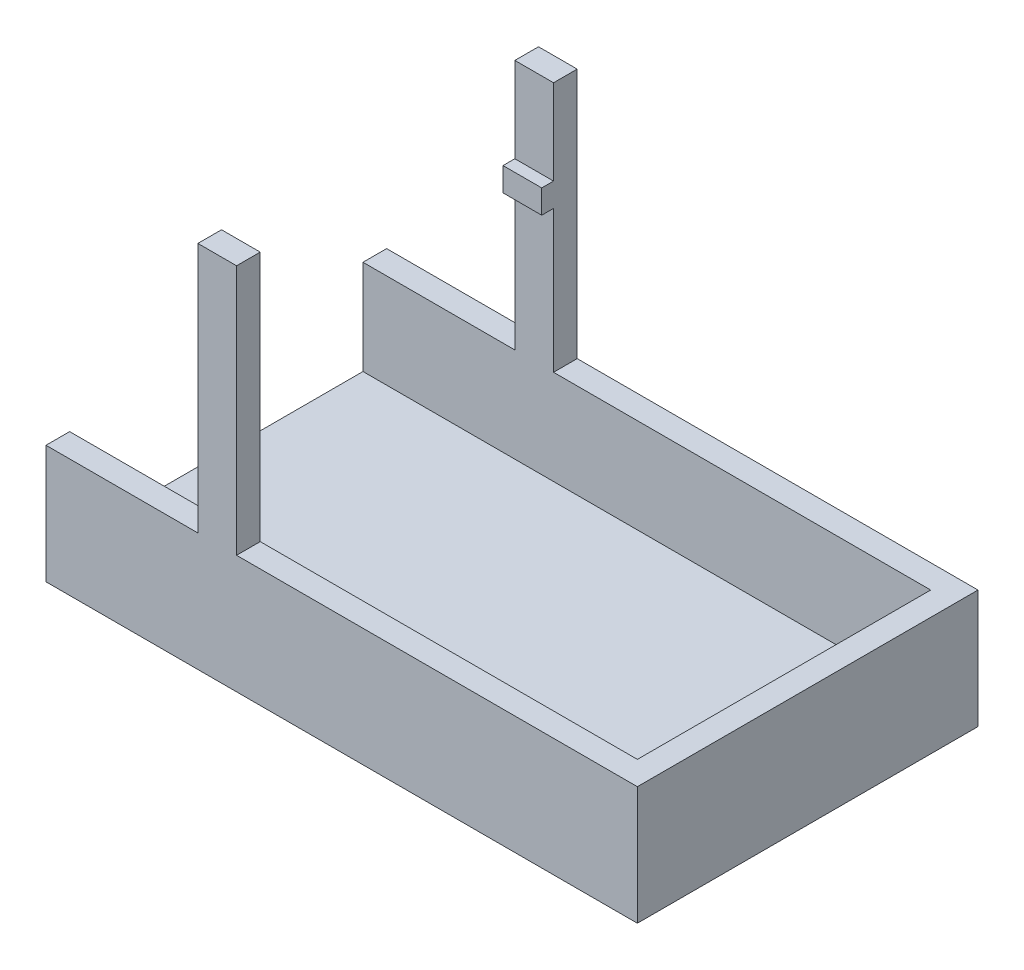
from build123d import *

# Parameters (mm, degrees)
SKETCH1_W      = 250
SKETCH1_H      = 50
EXTRUDE1_DEPTH = 72
SHELL1_T       = -10
SKETCH2_W      = 16.36174327
SKETCH2_H      = 10
EXTRUDE2_DEPTH = 106
SKETCH5_W      = 16.36174327
SKETCH5_H      = 10
EXTRUDE3_DEPTH = 5


with BuildPart() as part:
    # Sketch1 → Extrude1 (new, symmetric)
    with BuildSketch(Plane.XY):
        with Locations((125, 25)):
            Rectangle(SKETCH1_W, SKETCH1_H)
    extrude(amount=EXTRUDE1_DEPTH, both=True)

    # Shell1
    shell1_openings = [part.faces().sort_by_distance(p)[0] for p in [
        (0, 25, 0),
        (125, 50, 0),
    ]]
    offset(amount=SHELL1_T, openings=shell1_openings, kind=Kind.INTERSECTION)

    # Sketch2 → Extrude2 (add)
    with BuildSketch(Plane(origin=(0, 50, 0), x_dir=(-1, 0, 0), z_dir=(0, 1, 0))):
        with Locations((-72.382121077, 67)):
            Rectangle(SKETCH2_W, SKETCH2_H)
        with Locations((-72.382121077, -67)):
            Rectangle(SKETCH2_W, SKETCH2_H)
    extrude(amount=EXTRUDE2_DEPTH)

    # Sketch5 → Extrude3 (add)
    with BuildSketch(Plane.XY.offset(-62)):
        with Locations((72.382121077, 115)):
            Rectangle(SKETCH5_W, SKETCH5_H)
    extrude(amount=EXTRUDE3_DEPTH)


solid = part.part
